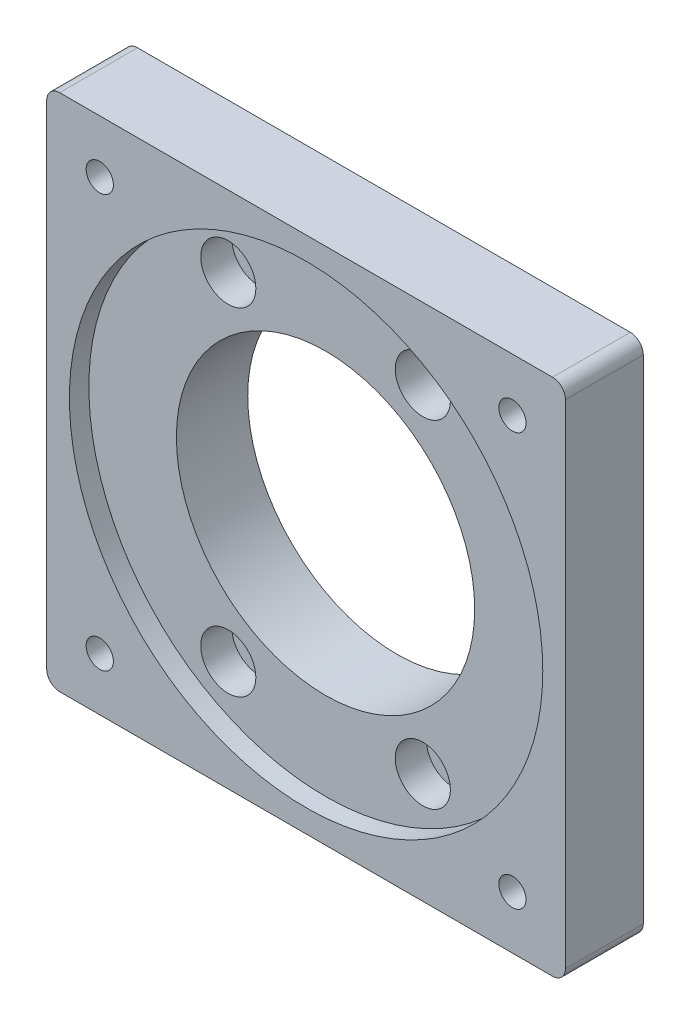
from build123d import *

# Parameters (mm, degrees)
SKETCH_1_W          = 80
SKETCH_1_H          = 80
SKETCH_1_R          = 23
EXTRUDE_1_DEPTH     = 12
SKETCH_2_R          = 2.1
CUT_EXTRUDE_1_DEPTH = 58.827329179
SKETCH_3_R          = 36.5
CUT_EXTRUDE_2_DEPTH = 3
SKETCH_5_R          = 2.25
CUT_EXTRUDE_3_DEPTH = 58.280013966
SKETCH_6_R          = 4.25
CUT_EXTRUDE_4_DEPTH = 4.8
FILLET_1_R          = 2
EXTRUDE_START       = 2
SKETCH_7_R          = 25
SKETCH_7_R_2        = 23
EXTRUDE_2_DEPTH     = 2


with BuildPart() as part:
    # Sketch 1 → Extrude 1 (new body)
    with BuildSketch(Plane.XY):
        Rectangle(SKETCH_1_W, SKETCH_1_H)
        Circle(SKETCH_1_R, mode=Mode.SUBTRACT)
    extrude(amount=EXTRUDE_1_DEPTH)

    # Sketch 2 → Cut-Extrude 1 (cut, through all)
    with BuildSketch(Plane.XY.offset(12)):
        with Locations((-31.819805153, 31.819805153)):
            Circle(SKETCH_2_R)
        with Locations((31.819805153, 31.819805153)):
            Circle(SKETCH_2_R)
        with Locations((31.819805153, -31.819805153)):
            Circle(SKETCH_2_R)
        with Locations((-31.819805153, -31.819805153)):
            Circle(SKETCH_2_R)
    extrude(amount=-CUT_EXTRUDE_1_DEPTH, mode=Mode.SUBTRACT)

    # Sketch 3 → Cut-Extrude 2 (cut)
    with BuildSketch(Plane.XY.offset(12)):
        Circle(SKETCH_3_R)
    extrude(amount=-CUT_EXTRUDE_2_DEPTH, mode=Mode.SUBTRACT)

    # Sketch 5 → Cut-Extrude 3 (cut, through all)
    with BuildSketch(Plane.XY.offset(9)):
        with Locations((-15, 25.980762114)):
            Circle(SKETCH_5_R)
        with Locations((15, 25.980762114)):
            Circle(SKETCH_5_R)
        with Locations((15, -25.980762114)):
            Circle(SKETCH_5_R)
        with Locations((-15, -25.980762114)):
            Circle(SKETCH_5_R)
    extrude(amount=-CUT_EXTRUDE_3_DEPTH, mode=Mode.SUBTRACT)

    # Sketch 6 → Cut-Extrude 4 (cut)
    with BuildSketch(Plane.XY.offset(9)):
        with Locations((-15, 25.980762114)):
            Circle(SKETCH_6_R)
        with Locations((15, 25.980762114)):
            Circle(SKETCH_6_R)
        with Locations((15, -25.980762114)):
            Circle(SKETCH_6_R)
        with Locations((-15, -25.980762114)):
            Circle(SKETCH_6_R)
    extrude(amount=-CUT_EXTRUDE_4_DEPTH, mode=Mode.SUBTRACT)

    # Fillet 1
    fillet_1_edges = [part.edges().sort_by_distance(p)[0] for p in [
        (40, -40, 6),
        (-40, -40, 6),
        (-40, 40, 6),
        (40, 40, 6),
    ]]
    fillet(fillet_1_edges, radius=FILLET_1_R)

    # Sketch 7 → Extrude 2 (add)
    with BuildSketch(Plane(origin=(0, 0, 0), x_dir=(-1, 0, 0), z_dir=(0, 0, -1)).offset(EXTRUDE_START)):
        Circle(SKETCH_7_R)
        Circle(SKETCH_7_R_2, mode=Mode.SUBTRACT)
    extrude(amount=-EXTRUDE_2_DEPTH)


solid = part.part
